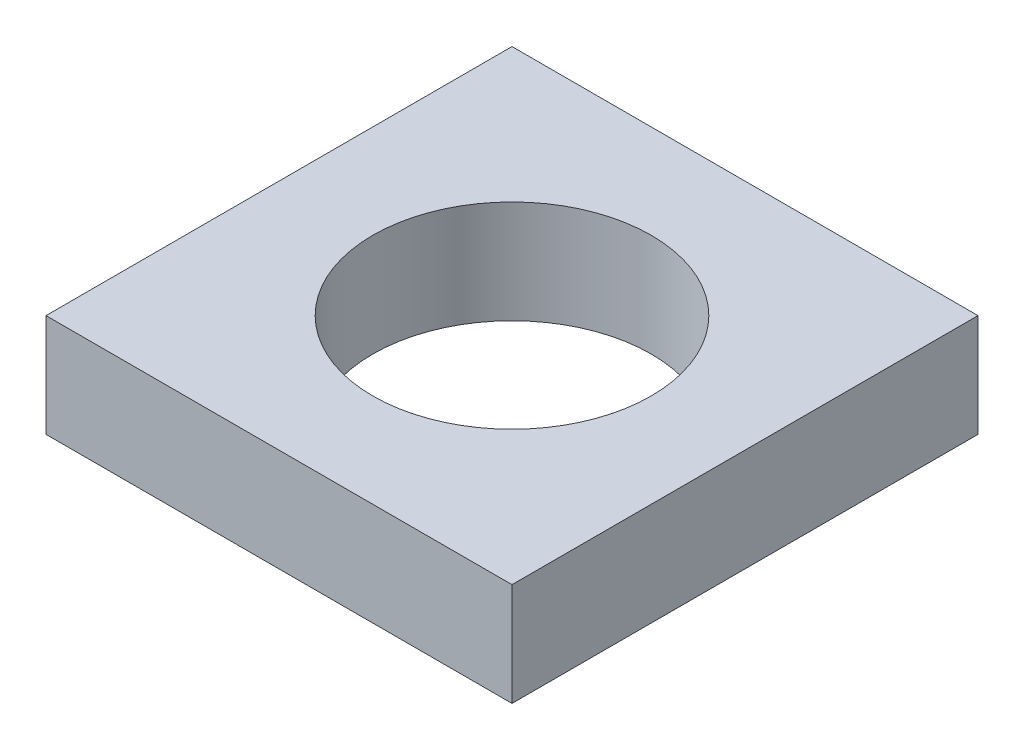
from build123d import *

# Parameters (mm, degrees)
SKETCH1_W           = 9.779
SKETCH1_H           = 9.779
BOSS_EXTRUDE1_DEPTH = 2.159
SKETCH2_R           = 2.921
CUT_EXTRUDE1_DEPTH  = 8.244011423


with BuildPart() as part:
    # Sketch1 → Boss-Extrude1 (new body)
    with BuildSketch(Plane(origin=(0, 0, 0), x_dir=(1, 0, 0), z_dir=(0, 1, 0))):
        Rectangle(SKETCH1_W, SKETCH1_H)
    extrude(amount=BOSS_EXTRUDE1_DEPTH)

    # Sketch2 → Cut-Extrude1 (cut, through all)
    with BuildSketch(Plane(origin=(0, 2.159, 0), x_dir=(1, 0, 0), z_dir=(0, 1, 0))):
        with Locations(Location((0, 0, 0), (0, 0, 270))):
            Circle(SKETCH2_R)
    extrude(amount=-CUT_EXTRUDE1_DEPTH, mode=Mode.SUBTRACT)


solid = part.part
